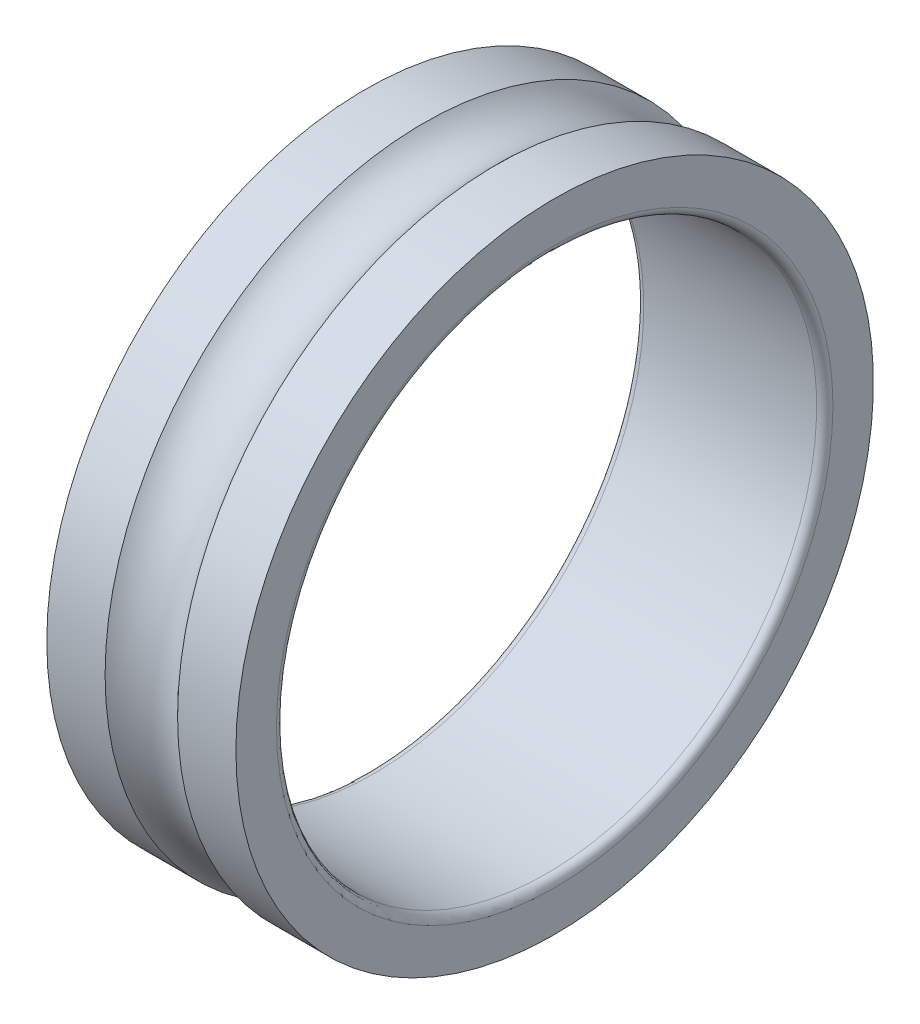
from build123d import *


with BuildPart() as part:
    # Esquisse1 → Base-R_volution (revolve)
    with BuildSketch(Plane(origin=(0, 0, 0), x_dir=(1, 0, 0), z_dir=(0, 1, 0)), mode=Mode.PRIVATE) as base_r_volution_sk:
        with BuildLine():
            Line((0, 11.8), (0, 10.3))
            ThreePointArc((0, 10.3), (0.087867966, 10.087867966), (0.3, 10))
            Line((0.3, 10), (6.7, 10))
            ThreePointArc((6.7, 10), (6.912132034, 10.087867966), (7, 10.3))
            Line((7, 10.3), (7, 11.8))
            Line((7, 11.8), (4.841640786, 11.8))
            ThreePointArc((4.841640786, 11.8), (3.5, 11.2), (2.158359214, 11.8))
            Line((2.158359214, 11.8), (0, 11.8))
        make_face()
    revolve(base_r_volution_sk.sketch.rotate(Axis((0, 0, 0), (1, 0, 0)), 180), axis=Axis((0, 0, 0), (1, 0, 0)))


solid = part.part
